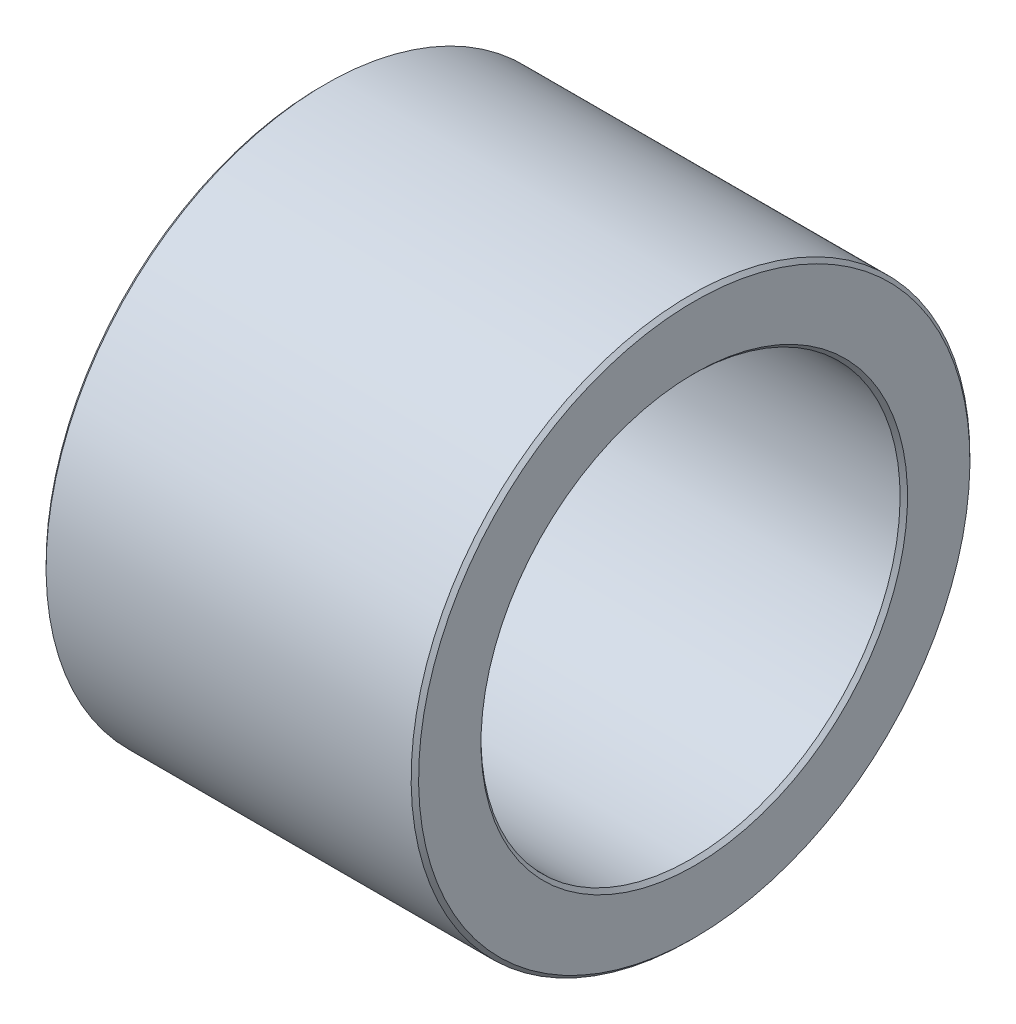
ISO-10303-21;
HEADER;
FILE_DESCRIPTION(('STEP AP214'),'2;1');
FILE_NAME('part.step','',(''),(''),'','','');
FILE_SCHEMA(('AUTOMOTIVE_DESIGN { 1 0 10303 214 1 1 1 1 }'));
ENDSEC;
DATA;
#1=APPLICATION_CONTEXT('core data for automotive mechanical design processes');
#2=APPLICATION_PROTOCOL_DEFINITION('international standard','automotive_design',2000,#1);
#3=PRODUCT_CONTEXT('',#1,'mechanical');
#4=PRODUCT('Part','Part','',(#3));
#5=PRODUCT_RELATED_PRODUCT_CATEGORY('part','',(#4));
#6=PRODUCT_DEFINITION_FORMATION('','',#4);
#7=PRODUCT_DEFINITION_CONTEXT('part definition',#1,'design');
#8=PRODUCT_DEFINITION('design','',#6,#7);
#9=PRODUCT_DEFINITION_SHAPE('','',#8);
#10=(LENGTH_UNIT() NAMED_UNIT(*) SI_UNIT(.MILLI.,.METRE.));
#11=(NAMED_UNIT(*) PLANE_ANGLE_UNIT() SI_UNIT($,.RADIAN.));
#12=(NAMED_UNIT(*) SI_UNIT($,.STERADIAN.) SOLID_ANGLE_UNIT());
#13=UNCERTAINTY_MEASURE_WITH_UNIT(LENGTH_MEASURE(1.E-05),#10,'distance_accuracy_value','');
#14=(GEOMETRIC_REPRESENTATION_CONTEXT(3) GLOBAL_UNCERTAINTY_ASSIGNED_CONTEXT((#13)) GLOBAL_UNIT_ASSIGNED_CONTEXT((#10,
#11,#12)) REPRESENTATION_CONTEXT('',''));
#15=CARTESIAN_POINT('',(0.,0.,0.));
#16=DIRECTION('',(0.,0.,1.));
#17=DIRECTION('',(1.,0.,0.));
#18=AXIS2_PLACEMENT_3D('',#15,#16,#17);
#19=CARTESIAN_POINT('',(0.,-26.25,0.));
#20=DIRECTION('',(-1.,0.,0.));
#21=DIRECTION('',(0.,1.,0.));
#22=AXIS2_PLACEMENT_3D('',#19,#20,#21);
#23=PLANE('',#22);
#24=CARTESIAN_POINT('',(0.,0.,0.));
#25=DIRECTION('',(1.,0.,0.));
#26=DIRECTION('',(0.,-1.,0.));
#27=AXIS2_PLACEMENT_3D('',#24,#25,#26);
#28=CIRCLE('',#27,22.9);
#29=CARTESIAN_POINT('',(0.,-22.9,0.));
#30=VERTEX_POINT('',#29);
#31=EDGE_CURVE('E9',#30,#30,#28,.T.);
#32=ORIENTED_EDGE('',*,*,#31,.T.);
#33=EDGE_LOOP('',(#32));
#34=FACE_BOUND('',#33,.T.);
#35=CARTESIAN_POINT('',(0.,0.,0.));
#36=DIRECTION('',(1.,0.,0.));
#37=DIRECTION('',(0.,-1.,0.));
#38=AXIS2_PLACEMENT_3D('',#35,#36,#37);
#39=CIRCLE('',#38,29.6);
#40=CARTESIAN_POINT('',(0.,-29.6,0.));
#41=VERTEX_POINT('',#40);
#42=EDGE_CURVE('E53',#41,#41,#39,.T.);
#43=ORIENTED_EDGE('',*,*,#42,.F.);
#44=EDGE_LOOP('',(#43));
#45=FACE_BOUND('',#44,.T.);
#46=ADVANCED_FACE('F15',(#34,#45),#23,.T.);
#47=CARTESIAN_POINT('',(0.2,0.,0.));
#48=DIRECTION('',(-1.,0.,0.));
#49=DIRECTION('',(0.,-1.,0.));
#50=AXIS2_PLACEMENT_3D('',#47,#48,#49);
#51=CONICAL_SURFACE('',#50,22.7,0.78539816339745);
#52=CARTESIAN_POINT('',(0.4,0.,0.));
#53=DIRECTION('',(1.,0.,0.));
#54=DIRECTION('',(0.,-1.,0.));
#55=AXIS2_PLACEMENT_3D('',#52,#53,#54);
#56=CIRCLE('',#55,22.5);
#57=CARTESIAN_POINT('',(0.4,-22.5,0.));
#58=VERTEX_POINT('',#57);
#59=EDGE_CURVE('E22',#58,#58,#56,.T.);
#60=ORIENTED_EDGE('',*,*,#59,.T.);
#61=EDGE_LOOP('',(#60));
#62=FACE_BOUND('',#61,.T.);
#63=ORIENTED_EDGE('',*,*,#31,.F.);
#64=EDGE_LOOP('',(#63));
#65=FACE_BOUND('',#64,.T.);
#66=ADVANCED_FACE('F82',(#62,#65),#51,.F.);
#67=CARTESIAN_POINT('',(20.,0.,0.));
#68=DIRECTION('',(-1.,0.,0.));
#69=DIRECTION('',(0.,-1.,0.));
#70=AXIS2_PLACEMENT_3D('',#67,#68,#69);
#71=CYLINDRICAL_SURFACE('',#70,22.5);
#72=CARTESIAN_POINT('',(39.6,0.,0.));
#73=DIRECTION('',(1.,0.,0.));
#74=DIRECTION('',(0.,-1.,0.));
#75=AXIS2_PLACEMENT_3D('',#72,#73,#74);
#76=CIRCLE('',#75,22.5);
#77=CARTESIAN_POINT('',(39.6,-22.5,0.));
#78=VERTEX_POINT('',#77);
#79=EDGE_CURVE('E58',#78,#78,#76,.T.);
#80=ORIENTED_EDGE('',*,*,#79,.T.);
#81=EDGE_LOOP('',(#80));
#82=FACE_BOUND('',#81,.T.);
#83=ORIENTED_EDGE('',*,*,#59,.F.);
#84=EDGE_LOOP('',(#83));
#85=FACE_BOUND('',#84,.T.);
#86=ADVANCED_FACE('F66',(#82,#85),#71,.F.);
#87=CARTESIAN_POINT('',(39.8,0.,0.));
#88=DIRECTION('',(1.,0.,0.));
#89=DIRECTION('',(0.,-1.,0.));
#90=AXIS2_PLACEMENT_3D('',#87,#88,#89);
#91=CONICAL_SURFACE('',#90,22.7,0.785398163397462);
#92=CARTESIAN_POINT('',(40.,0.,0.));
#93=DIRECTION('',(1.,0.,0.));
#94=DIRECTION('',(0.,-1.,0.));
#95=AXIS2_PLACEMENT_3D('',#92,#93,#94);
#96=CIRCLE('',#95,22.9);
#97=CARTESIAN_POINT('',(40.,-22.9,0.));
#98=VERTEX_POINT('',#97);
#99=EDGE_CURVE('E63',#98,#98,#96,.T.);
#100=ORIENTED_EDGE('',*,*,#99,.T.);
#101=EDGE_LOOP('',(#100));
#102=FACE_BOUND('',#101,.T.);
#103=ORIENTED_EDGE('',*,*,#79,.F.);
#104=EDGE_LOOP('',(#103));
#105=FACE_BOUND('',#104,.T.);
#106=ADVANCED_FACE('F69',(#102,#105),#91,.F.);
#107=CARTESIAN_POINT('',(40.,-26.25,0.));
#108=DIRECTION('',(1.,0.,0.));
#109=DIRECTION('',(0.,-1.,0.));
#110=AXIS2_PLACEMENT_3D('',#107,#108,#109);
#111=PLANE('',#110);
#112=CARTESIAN_POINT('',(40.,0.,0.));
#113=DIRECTION('',(1.,0.,0.));
#114=DIRECTION('',(0.,-1.,0.));
#115=AXIS2_PLACEMENT_3D('',#112,#113,#114);
#116=CIRCLE('',#115,29.6);
#117=CARTESIAN_POINT('',(40.,-29.6,0.));
#118=VERTEX_POINT('',#117);
#119=EDGE_CURVE('E61',#118,#118,#116,.T.);
#120=ORIENTED_EDGE('',*,*,#119,.T.);
#121=EDGE_LOOP('',(#120));
#122=FACE_BOUND('',#121,.T.);
#123=ORIENTED_EDGE('',*,*,#99,.F.);
#124=EDGE_LOOP('',(#123));
#125=FACE_BOUND('',#124,.T.);
#126=ADVANCED_FACE('F71',(#122,#125),#111,.T.);
#127=CARTESIAN_POINT('',(39.8,0.,0.));
#128=DIRECTION('',(-1.,0.,0.));
#129=DIRECTION('',(0.,-1.,0.));
#130=AXIS2_PLACEMENT_3D('',#127,#128,#129);
#131=CONICAL_SURFACE('',#130,29.8,0.785398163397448);
#132=CARTESIAN_POINT('',(39.6,0.,0.));
#133=DIRECTION('',(1.,0.,0.));
#134=DIRECTION('',(0.,-1.,0.));
#135=AXIS2_PLACEMENT_3D('',#132,#133,#134);
#136=CIRCLE('',#135,30.);
#137=CARTESIAN_POINT('',(39.6,-30.,0.));
#138=VERTEX_POINT('',#137);
#139=EDGE_CURVE('E55',#138,#138,#136,.T.);
#140=ORIENTED_EDGE('',*,*,#139,.T.);
#141=EDGE_LOOP('',(#140));
#142=FACE_BOUND('',#141,.T.);
#143=ORIENTED_EDGE('',*,*,#119,.F.);
#144=EDGE_LOOP('',(#143));
#145=FACE_BOUND('',#144,.T.);
#146=ADVANCED_FACE('F79',(#142,#145),#131,.T.);
#147=CARTESIAN_POINT('',(20.,0.,0.));
#148=DIRECTION('',(-1.,0.,0.));
#149=DIRECTION('',(0.,-1.,0.));
#150=AXIS2_PLACEMENT_3D('',#147,#148,#149);
#151=CYLINDRICAL_SURFACE('',#150,30.);
#152=CARTESIAN_POINT('',(0.4,0.,0.));
#153=DIRECTION('',(1.,0.,0.));
#154=DIRECTION('',(0.,-1.,0.));
#155=AXIS2_PLACEMENT_3D('',#152,#153,#154);
#156=CIRCLE('',#155,30.);
#157=CARTESIAN_POINT('',(0.4,-30.,0.));
#158=VERTEX_POINT('',#157);
#159=EDGE_CURVE('E49',#158,#158,#156,.T.);
#160=ORIENTED_EDGE('',*,*,#159,.T.);
#161=EDGE_LOOP('',(#160));
#162=FACE_BOUND('',#161,.T.);
#163=ORIENTED_EDGE('',*,*,#139,.F.);
#164=EDGE_LOOP('',(#163));
#165=FACE_BOUND('',#164,.T.);
#166=ADVANCED_FACE('F50',(#162,#165),#151,.T.);
#167=CARTESIAN_POINT('',(0.2,0.,0.));
#168=DIRECTION('',(1.,0.,0.));
#169=DIRECTION('',(0.,-1.,0.));
#170=AXIS2_PLACEMENT_3D('',#167,#168,#169);
#171=CONICAL_SURFACE('',#170,29.8,0.785398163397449);
#172=ORIENTED_EDGE('',*,*,#42,.T.);
#173=EDGE_LOOP('',(#172));
#174=FACE_BOUND('',#173,.T.);
#175=ORIENTED_EDGE('',*,*,#159,.F.);
#176=EDGE_LOOP('',(#175));
#177=FACE_BOUND('',#176,.T.);
#178=ADVANCED_FACE('F92',(#174,#177),#171,.T.);
#179=CLOSED_SHELL('',(#46,#66,#86,#106,#126,#146,#166,#178));
#180=MANIFOLD_SOLID_BREP('B1',#179);
#181=ADVANCED_BREP_SHAPE_REPRESENTATION('',(#18,#180),#14);
#182=SHAPE_DEFINITION_REPRESENTATION(#9,#181);
ENDSEC;
END-ISO-10303-21;
